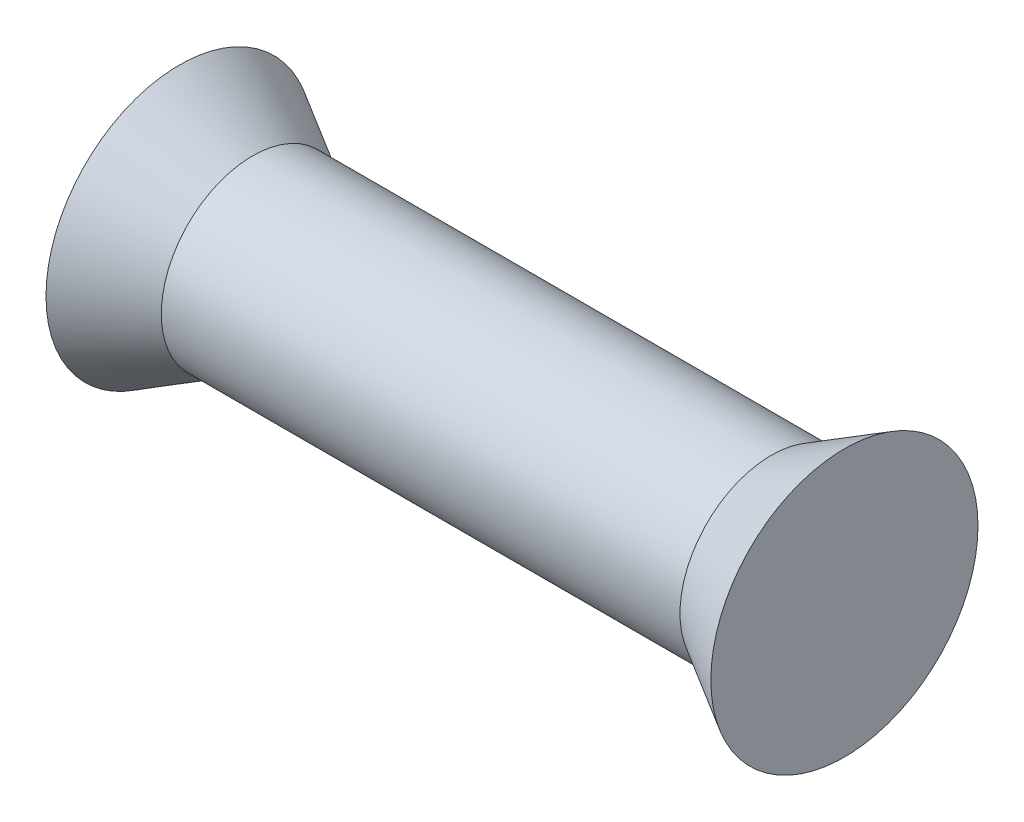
ISO-10303-21;
HEADER;
FILE_DESCRIPTION(('STEP AP214'),'2;1');
FILE_NAME('part.step','',(''),(''),'','','');
FILE_SCHEMA(('AUTOMOTIVE_DESIGN { 1 0 10303 214 1 1 1 1 }'));
ENDSEC;
DATA;
#1=APPLICATION_CONTEXT('core data for automotive mechanical design processes');
#2=APPLICATION_PROTOCOL_DEFINITION('international standard','automotive_design',2000,#1);
#3=PRODUCT_CONTEXT('',#1,'mechanical');
#4=PRODUCT('Part','Part','',(#3));
#5=PRODUCT_RELATED_PRODUCT_CATEGORY('part','',(#4));
#6=PRODUCT_DEFINITION_FORMATION('','',#4);
#7=PRODUCT_DEFINITION_CONTEXT('part definition',#1,'design');
#8=PRODUCT_DEFINITION('design','',#6,#7);
#9=PRODUCT_DEFINITION_SHAPE('','',#8);
#10=(LENGTH_UNIT() NAMED_UNIT(*) SI_UNIT(.MILLI.,.METRE.));
#11=(NAMED_UNIT(*) PLANE_ANGLE_UNIT() SI_UNIT($,.RADIAN.));
#12=(NAMED_UNIT(*) SI_UNIT($,.STERADIAN.) SOLID_ANGLE_UNIT());
#13=UNCERTAINTY_MEASURE_WITH_UNIT(LENGTH_MEASURE(1.E-05),#10,'distance_accuracy_value','');
#14=(GEOMETRIC_REPRESENTATION_CONTEXT(3) GLOBAL_UNCERTAINTY_ASSIGNED_CONTEXT((#13)) GLOBAL_UNIT_ASSIGNED_CONTEXT((#10,
#11,#12)) REPRESENTATION_CONTEXT('',''));
#15=CARTESIAN_POINT('',(0.,0.,0.));
#16=DIRECTION('',(0.,0.,1.));
#17=DIRECTION('',(1.,0.,0.));
#18=AXIS2_PLACEMENT_3D('',#15,#16,#17);
#19=CARTESIAN_POINT('',(0.,0.,0.));
#20=DIRECTION('',(1.,0.,0.));
#21=DIRECTION('',(0.,0.,-1.));
#22=AXIS2_PLACEMENT_3D('',#19,#20,#21);
#23=PLANE('',#22);
#24=CARTESIAN_POINT('',(0.,0.,0.));
#25=DIRECTION('',(1.,0.,0.));
#26=DIRECTION('',(0.,0.,-1.));
#27=AXIS2_PLACEMENT_3D('',#24,#25,#26);
#28=CIRCLE('',#27,2.87771120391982);
#29=CARTESIAN_POINT('',(0.,0.,-2.87771120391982));
#30=VERTEX_POINT('',#29);
#31=EDGE_CURVE('E10',#30,#30,#28,.T.);
#32=ORIENTED_EDGE('',*,*,#31,.T.);
#33=EDGE_LOOP('',(#32));
#34=FACE_BOUND('',#33,.T.);
#35=ADVANCED_FACE('F32',(#34),#23,.T.);
#36=CARTESIAN_POINT('',(0.,0.,0.));
#37=DIRECTION('',(1.,0.,0.));
#38=DIRECTION('',(0.,0.,-1.));
#39=AXIS2_PLACEMENT_3D('',#36,#37,#38);
#40=CONICAL_SURFACE('',#39,2.87771120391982,0.523598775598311);
#41=CARTESIAN_POINT('',(-1.57480000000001,0.,0.));
#42=DIRECTION('',(1.,0.,0.));
#43=DIRECTION('',(0.,0.,-1.));
#44=AXIS2_PLACEMENT_3D('',#41,#42,#43);
#45=CIRCLE('',#44,1.96849999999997);
#46=CARTESIAN_POINT('',(-1.57480000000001,0.,-1.96849999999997));
#47=VERTEX_POINT('',#46);
#48=EDGE_CURVE('E38',#47,#47,#45,.T.);
#49=ORIENTED_EDGE('',*,*,#48,.T.);
#50=EDGE_LOOP('',(#49));
#51=FACE_BOUND('',#50,.T.);
#52=ORIENTED_EDGE('',*,*,#31,.F.);
#53=EDGE_LOOP('',(#52));
#54=FACE_BOUND('',#53,.T.);
#55=ADVANCED_FACE('F64',(#51,#54),#40,.T.);
#56=CARTESIAN_POINT('',(0.,0.,0.));
#57=DIRECTION('',(1.,0.,0.));
#58=DIRECTION('',(0.,0.,-1.));
#59=AXIS2_PLACEMENT_3D('',#56,#57,#58);
#60=CYLINDRICAL_SURFACE('',#59,1.96849999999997);
#61=CARTESIAN_POINT('',(-12.7508,0.,0.));
#62=DIRECTION('',(1.,0.,0.));
#63=DIRECTION('',(0.,0.,-1.));
#64=AXIS2_PLACEMENT_3D('',#61,#62,#63);
#65=CIRCLE('',#64,1.96849999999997);
#66=CARTESIAN_POINT('',(-12.7508,0.,-1.96849999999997));
#67=VERTEX_POINT('',#66);
#68=EDGE_CURVE('E42',#67,#67,#65,.T.);
#69=ORIENTED_EDGE('',*,*,#68,.T.);
#70=EDGE_LOOP('',(#69));
#71=FACE_BOUND('',#70,.T.);
#72=ORIENTED_EDGE('',*,*,#48,.F.);
#73=EDGE_LOOP('',(#72));
#74=FACE_BOUND('',#73,.T.);
#75=ADVANCED_FACE('F61',(#71,#74),#60,.T.);
#76=CARTESIAN_POINT('',(-12.7508,0.,0.));
#77=DIRECTION('',(-1.,0.,0.));
#78=DIRECTION('',(0.,0.,1.));
#79=AXIS2_PLACEMENT_3D('',#76,#77,#78);
#80=CONICAL_SURFACE('',#79,1.96849999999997,0.5235987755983);
#81=CARTESIAN_POINT('',(-14.3256,0.,0.));
#82=DIRECTION('',(1.,0.,0.));
#83=DIRECTION('',(0.,0.,-1.));
#84=AXIS2_PLACEMENT_3D('',#81,#82,#83);
#85=CIRCLE('',#84,2.87771120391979);
#86=CARTESIAN_POINT('',(-14.3256,0.,-2.87771120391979));
#87=VERTEX_POINT('',#86);
#88=EDGE_CURVE('E46',#87,#87,#85,.T.);
#89=ORIENTED_EDGE('',*,*,#88,.T.);
#90=EDGE_LOOP('',(#89));
#91=FACE_BOUND('',#90,.T.);
#92=ORIENTED_EDGE('',*,*,#68,.F.);
#93=EDGE_LOOP('',(#92));
#94=FACE_BOUND('',#93,.T.);
#95=ADVANCED_FACE('F52',(#91,#94),#80,.T.);
#96=CARTESIAN_POINT('',(-14.3256,2.87771120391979,0.));
#97=DIRECTION('',(-1.,0.,0.));
#98=DIRECTION('',(0.,0.,1.));
#99=AXIS2_PLACEMENT_3D('',#96,#97,#98);
#100=PLANE('',#99);
#101=ORIENTED_EDGE('',*,*,#88,.F.);
#102=EDGE_LOOP('',(#101));
#103=FACE_BOUND('',#102,.T.);
#104=ADVANCED_FACE('F55',(#103),#100,.T.);
#105=CLOSED_SHELL('',(#35,#55,#75,#95,#104));
#106=MANIFOLD_SOLID_BREP('B2',#105);
#107=ADVANCED_BREP_SHAPE_REPRESENTATION('',(#18,#106),#14);
#108=SHAPE_DEFINITION_REPRESENTATION(#9,#107);
ENDSEC;
END-ISO-10303-21;
